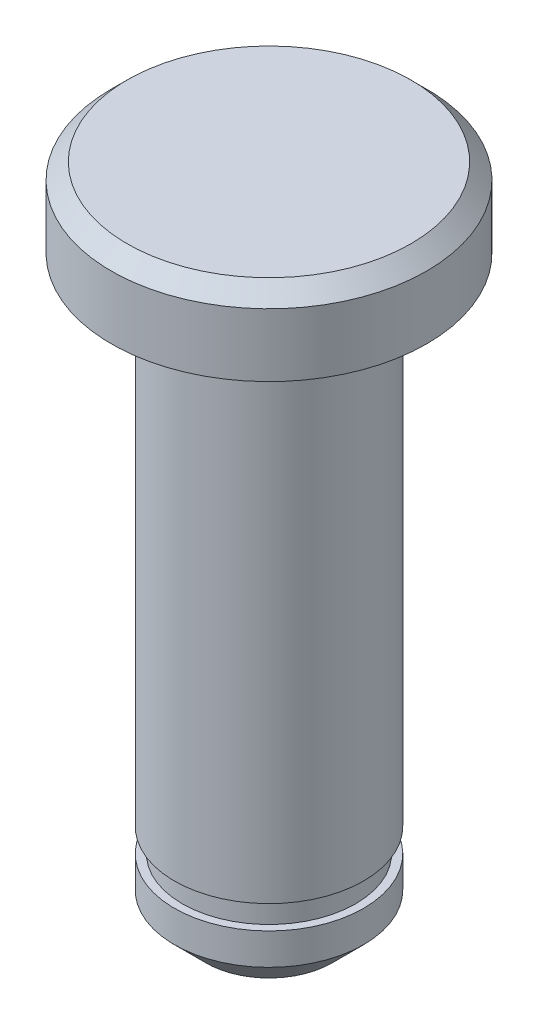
ISO-10303-21;
HEADER;
FILE_DESCRIPTION(('STEP AP214'),'2;1');
FILE_NAME('part.step','',(''),(''),'','','');
FILE_SCHEMA(('AUTOMOTIVE_DESIGN { 1 0 10303 214 1 1 1 1 }'));
ENDSEC;
DATA;
#1=APPLICATION_CONTEXT('core data for automotive mechanical design processes');
#2=APPLICATION_PROTOCOL_DEFINITION('international standard','automotive_design',2000,#1);
#3=PRODUCT_CONTEXT('',#1,'mechanical');
#4=PRODUCT('Part','Part','',(#3));
#5=PRODUCT_RELATED_PRODUCT_CATEGORY('part','',(#4));
#6=PRODUCT_DEFINITION_FORMATION('','',#4);
#7=PRODUCT_DEFINITION_CONTEXT('part definition',#1,'design');
#8=PRODUCT_DEFINITION('design','',#6,#7);
#9=PRODUCT_DEFINITION_SHAPE('','',#8);
#10=(LENGTH_UNIT() NAMED_UNIT(*) SI_UNIT(.MILLI.,.METRE.));
#11=(NAMED_UNIT(*) PLANE_ANGLE_UNIT() SI_UNIT($,.RADIAN.));
#12=(NAMED_UNIT(*) SI_UNIT($,.STERADIAN.) SOLID_ANGLE_UNIT());
#13=UNCERTAINTY_MEASURE_WITH_UNIT(LENGTH_MEASURE(1.E-05),#10,'distance_accuracy_value','');
#14=(GEOMETRIC_REPRESENTATION_CONTEXT(3) GLOBAL_UNCERTAINTY_ASSIGNED_CONTEXT((#13)) GLOBAL_UNIT_ASSIGNED_CONTEXT((#10,
#11,#12)) REPRESENTATION_CONTEXT('',''));
#15=CARTESIAN_POINT('',(0.,0.,0.));
#16=DIRECTION('',(0.,0.,1.));
#17=DIRECTION('',(1.,0.,0.));
#18=AXIS2_PLACEMENT_3D('',#15,#16,#17);
#19=CARTESIAN_POINT('',(1.02351577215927E-11,2.00000000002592,0.));
#20=DIRECTION('',(0.,-1.,0.));
#21=DIRECTION('',(1.,0.,0.));
#22=AXIS2_PLACEMENT_3D('',#19,#20,#21);
#23=CONICAL_SURFACE('',#22,5.00000000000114,0.785398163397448);
#24=CARTESIAN_POINT('',(1.02350964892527E-11,2.50000000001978,0.));
#25=DIRECTION('',(0.,-1.,0.));
#26=DIRECTION('',(1.,0.,0.));
#27=AXIS2_PLACEMENT_3D('',#24,#25,#26);
#28=CIRCLE('',#27,4.50000000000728);
#29=CARTESIAN_POINT('',(4.50000000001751,2.50000000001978,0.));
#30=VERTEX_POINT('',#29);
#31=EDGE_CURVE('E64',#30,#30,#28,.T.);
#32=ORIENTED_EDGE('',*,*,#31,.T.);
#33=EDGE_LOOP('',(#32));
#34=FACE_BOUND('',#33,.T.);
#35=CARTESIAN_POINT('',(1.02351577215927E-11,2.00000000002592,0.));
#36=DIRECTION('',(0.,-1.,0.));
#37=DIRECTION('',(1.,0.,0.));
#38=AXIS2_PLACEMENT_3D('',#35,#36,#37);
#39=CIRCLE('',#38,5.00000000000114);
#40=CARTESIAN_POINT('',(5.00000000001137,2.00000000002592,0.));
#41=VERTEX_POINT('',#40);
#42=EDGE_CURVE('E10',#41,#41,#39,.T.);
#43=ORIENTED_EDGE('',*,*,#42,.F.);
#44=EDGE_LOOP('',(#43));
#45=FACE_BOUND('',#44,.T.);
#46=ADVANCED_FACE('F30',(#34,#45),#23,.T.);
#47=CARTESIAN_POINT('',(1.02350964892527E-11,2.50000000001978,0.));
#48=DIRECTION('',(0.,-1.,0.));
#49=DIRECTION('',(1.,0.,0.));
#50=AXIS2_PLACEMENT_3D('',#47,#48,#49);
#51=CYLINDRICAL_SURFACE('',#50,5.00000000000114);
#52=ORIENTED_EDGE('',*,*,#42,.T.);
#53=EDGE_LOOP('',(#52));
#54=FACE_BOUND('',#53,.T.);
#55=CARTESIAN_POINT('',(1.02354026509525E-11,0.,0.));
#56=DIRECTION('',(0.,-1.,0.));
#57=DIRECTION('',(1.,0.,0.));
#58=AXIS2_PLACEMENT_3D('',#55,#56,#57);
#59=CIRCLE('',#58,5.00000000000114);
#60=CARTESIAN_POINT('',(5.00000000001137,0.,0.));
#61=VERTEX_POINT('',#60);
#62=EDGE_CURVE('E36',#61,#61,#59,.T.);
#63=ORIENTED_EDGE('',*,*,#62,.F.);
#64=EDGE_LOOP('',(#63));
#65=FACE_BOUND('',#64,.T.);
#66=ADVANCED_FACE('F81',(#54,#65),#51,.T.);
#67=CARTESIAN_POINT('',(3.,0.,0.));
#68=DIRECTION('',(0.,-1.,0.));
#69=DIRECTION('',(1.,0.,0.));
#70=AXIS2_PLACEMENT_3D('',#67,#68,#69);
#71=PLANE('',#70);
#72=ORIENTED_EDGE('',*,*,#62,.T.);
#73=EDGE_LOOP('',(#72));
#74=FACE_BOUND('',#73,.T.);
#75=CARTESIAN_POINT('',(1.02354026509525E-11,0.,0.));
#76=DIRECTION('',(0.,-1.,0.));
#77=DIRECTION('',(1.,0.,0.));
#78=AXIS2_PLACEMENT_3D('',#75,#76,#77);
#79=CIRCLE('',#78,2.99999999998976);
#80=CARTESIAN_POINT('',(3.,0.,0.));
#81=VERTEX_POINT('',#80);
#82=EDGE_CURVE('E40',#81,#81,#79,.T.);
#83=ORIENTED_EDGE('',*,*,#82,.F.);
#84=EDGE_LOOP('',(#83));
#85=FACE_BOUND('',#84,.T.);
#86=ADVANCED_FACE('F85',(#74,#85),#71,.T.);
#87=CARTESIAN_POINT('',(1.02350964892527E-11,2.50000000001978,0.));
#88=DIRECTION('',(0.,-1.,0.));
#89=DIRECTION('',(1.,0.,0.));
#90=AXIS2_PLACEMENT_3D('',#87,#88,#89);
#91=CYLINDRICAL_SURFACE('',#90,2.99999999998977);
#92=ORIENTED_EDGE('',*,*,#82,.T.);
#93=EDGE_LOOP('',(#92));
#94=FACE_BOUND('',#93,.T.);
#95=CARTESIAN_POINT('',(1.02373314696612E-11,-15.75,0.));
#96=DIRECTION('',(0.,-1.,0.));
#97=DIRECTION('',(1.,0.,0.));
#98=AXIS2_PLACEMENT_3D('',#95,#96,#97);
#99=CIRCLE('',#98,2.99999999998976);
#100=CARTESIAN_POINT('',(3.,-15.75,0.));
#101=VERTEX_POINT('',#100);
#102=EDGE_CURVE('E44',#101,#101,#99,.T.);
#103=ORIENTED_EDGE('',*,*,#102,.F.);
#104=EDGE_LOOP('',(#103));
#105=FACE_BOUND('',#104,.T.);
#106=ADVANCED_FACE('F89',(#94,#105),#91,.T.);
#107=CARTESIAN_POINT('',(2.75,-15.75,0.));
#108=DIRECTION('',(0.,-1.,0.));
#109=DIRECTION('',(1.,0.,0.));
#110=AXIS2_PLACEMENT_3D('',#107,#108,#109);
#111=PLANE('',#110);
#112=ORIENTED_EDGE('',*,*,#102,.T.);
#113=EDGE_LOOP('',(#112));
#114=FACE_BOUND('',#113,.T.);
#115=CARTESIAN_POINT('',(1.02373314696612E-11,-15.75,0.));
#116=DIRECTION('',(0.,-1.,0.));
#117=DIRECTION('',(1.,0.,0.));
#118=AXIS2_PLACEMENT_3D('',#115,#116,#117);
#119=CIRCLE('',#118,2.74999999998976);
#120=CARTESIAN_POINT('',(2.75,-15.75,0.));
#121=VERTEX_POINT('',#120);
#122=EDGE_CURVE('E49',#121,#121,#119,.T.);
#123=ORIENTED_EDGE('',*,*,#122,.F.);
#124=EDGE_LOOP('',(#123));
#125=FACE_BOUND('',#124,.T.);
#126=ADVANCED_FACE('F95',(#114,#125),#111,.T.);
#127=CARTESIAN_POINT('',(1.02350964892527E-11,2.50000000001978,0.));
#128=DIRECTION('',(0.,-1.,0.));
#129=DIRECTION('',(1.,0.,0.));
#130=AXIS2_PLACEMENT_3D('',#127,#128,#129);
#131=CYLINDRICAL_SURFACE('',#130,2.74999999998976);
#132=ORIENTED_EDGE('',*,*,#122,.T.);
#133=EDGE_LOOP('',(#132));
#134=FACE_BOUND('',#133,.T.);
#135=CARTESIAN_POINT('',(1.02374233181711E-11,-16.5,0.));
#136=DIRECTION('',(0.,-1.,0.));
#137=DIRECTION('',(1.,0.,0.));
#138=AXIS2_PLACEMENT_3D('',#135,#136,#137);
#139=CIRCLE('',#138,2.74999999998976);
#140=CARTESIAN_POINT('',(2.75,-16.5,0.));
#141=VERTEX_POINT('',#140);
#142=EDGE_CURVE('E52',#141,#141,#139,.T.);
#143=ORIENTED_EDGE('',*,*,#142,.F.);
#144=EDGE_LOOP('',(#143));
#145=FACE_BOUND('',#144,.T.);
#146=ADVANCED_FACE('F99',(#134,#145),#131,.T.);
#147=CARTESIAN_POINT('',(3.,-16.5,0.));
#148=DIRECTION('',(0.,1.,0.));
#149=DIRECTION('',(-1.,0.,0.));
#150=AXIS2_PLACEMENT_3D('',#147,#148,#149);
#151=PLANE('',#150);
#152=ORIENTED_EDGE('',*,*,#142,.T.);
#153=EDGE_LOOP('',(#152));
#154=FACE_BOUND('',#153,.T.);
#155=CARTESIAN_POINT('',(1.02374233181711E-11,-16.5,0.));
#156=DIRECTION('',(0.,-1.,0.));
#157=DIRECTION('',(1.,0.,0.));
#158=AXIS2_PLACEMENT_3D('',#155,#156,#157);
#159=CIRCLE('',#158,2.99999999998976);
#160=CARTESIAN_POINT('',(3.,-16.5,0.));
#161=VERTEX_POINT('',#160);
#162=EDGE_CURVE('E55',#161,#161,#159,.T.);
#163=ORIENTED_EDGE('',*,*,#162,.F.);
#164=EDGE_LOOP('',(#163));
#165=FACE_BOUND('',#164,.T.);
#166=ADVANCED_FACE('F103',(#154,#165),#151,.T.);
#167=CARTESIAN_POINT('',(1.02350964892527E-11,2.50000000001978,0.));
#168=DIRECTION('',(0.,-1.,0.));
#169=DIRECTION('',(1.,0.,0.));
#170=AXIS2_PLACEMENT_3D('',#167,#168,#169);
#171=CYLINDRICAL_SURFACE('',#170,2.99999999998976);
#172=ORIENTED_EDGE('',*,*,#162,.T.);
#173=EDGE_LOOP('',(#172));
#174=FACE_BOUND('',#173,.T.);
#175=CARTESIAN_POINT('',(1.0237545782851E-11,-17.5,0.));
#176=DIRECTION('',(0.,-1.,0.));
#177=DIRECTION('',(1.,0.,0.));
#178=AXIS2_PLACEMENT_3D('',#175,#176,#177);
#179=CIRCLE('',#178,2.99999999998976);
#180=CARTESIAN_POINT('',(3.,-17.5,0.));
#181=VERTEX_POINT('',#180);
#182=EDGE_CURVE('E58',#181,#181,#179,.T.);
#183=ORIENTED_EDGE('',*,*,#182,.F.);
#184=EDGE_LOOP('',(#183));
#185=FACE_BOUND('',#184,.T.);
#186=ADVANCED_FACE('F107',(#174,#185),#171,.T.);
#187=CARTESIAN_POINT('',(1.02376682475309E-11,-18.4999999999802,0.));
#188=DIRECTION('',(0.,1.,0.));
#189=DIRECTION('',(-1.,0.,0.));
#190=AXIS2_PLACEMENT_3D('',#187,#188,#189);
#191=CONICAL_SURFACE('',#190,2.00000000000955,0.785398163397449);
#192=ORIENTED_EDGE('',*,*,#182,.T.);
#193=EDGE_LOOP('',(#192));
#194=FACE_BOUND('',#193,.T.);
#195=CARTESIAN_POINT('',(1.02376682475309E-11,-18.4999999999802,0.));
#196=DIRECTION('',(0.,-1.,0.));
#197=DIRECTION('',(1.,0.,0.));
#198=AXIS2_PLACEMENT_3D('',#195,#196,#197);
#199=CIRCLE('',#198,2.00000000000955);
#200=CARTESIAN_POINT('',(2.00000000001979,-18.4999999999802,0.));
#201=VERTEX_POINT('',#200);
#202=EDGE_CURVE('E61',#201,#201,#199,.T.);
#203=ORIENTED_EDGE('',*,*,#202,.F.);
#204=EDGE_LOOP('',(#203));
#205=FACE_BOUND('',#204,.T.);
#206=ADVANCED_FACE('F77',(#194,#205),#191,.T.);
#207=CARTESIAN_POINT('',(1.02376682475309E-11,-18.4999999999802,0.));
#208=DIRECTION('',(0.,-1.,0.));
#209=DIRECTION('',(1.,0.,0.));
#210=AXIS2_PLACEMENT_3D('',#207,#208,#209);
#211=PLANE('',#210);
#212=ORIENTED_EDGE('',*,*,#202,.T.);
#213=EDGE_LOOP('',(#212));
#214=FACE_BOUND('',#213,.T.);
#215=ADVANCED_FACE('F72',(#214),#211,.T.);
#216=CARTESIAN_POINT('',(4.50000000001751,2.50000000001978,0.));
#217=DIRECTION('',(0.,1.,0.));
#218=DIRECTION('',(-1.,0.,0.));
#219=AXIS2_PLACEMENT_3D('',#216,#217,#218);
#220=PLANE('',#219);
#221=ORIENTED_EDGE('',*,*,#31,.F.);
#222=EDGE_LOOP('',(#221));
#223=FACE_BOUND('',#222,.T.);
#224=ADVANCED_FACE('F70',(#223),#220,.T.);
#225=CLOSED_SHELL('',(#46,#66,#86,#106,#126,#146,#166,#186,#206,#215,#224));
#226=MANIFOLD_SOLID_BREP('B2',#225);
#227=ADVANCED_BREP_SHAPE_REPRESENTATION('',(#18,#226),#14);
#228=SHAPE_DEFINITION_REPRESENTATION(#9,#227);
ENDSEC;
END-ISO-10303-21;
